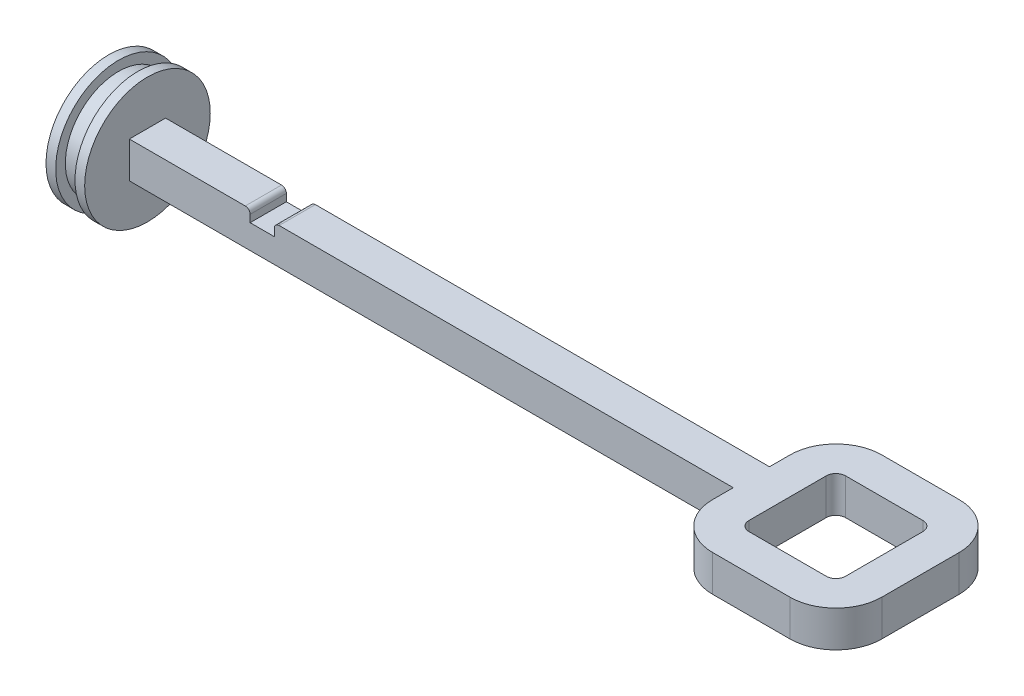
ISO-10303-21;
HEADER;
FILE_DESCRIPTION(('STEP AP214'),'2;1');
FILE_NAME('part.step','',(''),(''),'','','');
FILE_SCHEMA(('AUTOMOTIVE_DESIGN { 1 0 10303 214 1 1 1 1 }'));
ENDSEC;
DATA;
#1=APPLICATION_CONTEXT('core data for automotive mechanical design processes');
#2=APPLICATION_PROTOCOL_DEFINITION('international standard','automotive_design',2000,#1);
#3=PRODUCT_CONTEXT('',#1,'mechanical');
#4=PRODUCT('Part','Part','',(#3));
#5=PRODUCT_RELATED_PRODUCT_CATEGORY('part','',(#4));
#6=PRODUCT_DEFINITION_FORMATION('','',#4);
#7=PRODUCT_DEFINITION_CONTEXT('part definition',#1,'design');
#8=PRODUCT_DEFINITION('design','',#6,#7);
#9=PRODUCT_DEFINITION_SHAPE('','',#8);
#10=(LENGTH_UNIT() NAMED_UNIT(*) SI_UNIT(.MILLI.,.METRE.));
#11=(NAMED_UNIT(*) PLANE_ANGLE_UNIT() SI_UNIT($,.RADIAN.));
#12=(NAMED_UNIT(*) SI_UNIT($,.STERADIAN.) SOLID_ANGLE_UNIT());
#13=UNCERTAINTY_MEASURE_WITH_UNIT(LENGTH_MEASURE(1.E-05),#10,'distance_accuracy_value','');
#14=(GEOMETRIC_REPRESENTATION_CONTEXT(3) GLOBAL_UNCERTAINTY_ASSIGNED_CONTEXT((#13)) GLOBAL_UNIT_ASSIGNED_CONTEXT((#10,
#11,#12)) REPRESENTATION_CONTEXT('',''));
#15=CARTESIAN_POINT('',(0.,0.,0.));
#16=DIRECTION('',(0.,0.,1.));
#17=DIRECTION('',(1.,0.,0.));
#18=AXIS2_PLACEMENT_3D('',#15,#16,#17);
#19=CARTESIAN_POINT('',(0.,3.75,0.));
#20=DIRECTION('',(0.,1.,0.));
#21=DIRECTION('',(0.,0.,1.));
#22=AXIS2_PLACEMENT_3D('',#19,#20,#21);
#23=PLANE('',#22);
#24=DIRECTION('',(1.,0.,0.));
#25=VECTOR('',#24,1.);
#26=CARTESIAN_POINT('',(-62.5,3.75,3.75));
#27=LINE('',#26,#25);
#28=CARTESIAN_POINT('',(-62.5,3.75,3.75));
#29=VERTEX_POINT('',#28);
#30=CARTESIAN_POINT('',(-38.5,3.75,3.75));
#31=VERTEX_POINT('',#30);
#32=EDGE_CURVE('E321',#29,#31,#27,.T.);
#33=ORIENTED_EDGE('',*,*,#32,.T.);
#34=DIRECTION('',(0.,0.,1.));
#35=VECTOR('',#34,1.);
#36=CARTESIAN_POINT('',(-38.5,3.75,-3.75));
#37=LINE('',#36,#35);
#38=CARTESIAN_POINT('',(-38.5,3.75,-3.75));
#39=VERTEX_POINT('',#38);
#40=EDGE_CURVE('E11',#31,#39,#37,.F.);
#41=ORIENTED_EDGE('',*,*,#40,.T.);
#42=DIRECTION('',(-1.,0.,0.));
#43=VECTOR('',#42,1.);
#44=CARTESIAN_POINT('',(-62.5,3.75,-3.75));
#45=LINE('',#44,#43);
#46=CARTESIAN_POINT('',(-62.5,3.75,-3.75));
#47=VERTEX_POINT('',#46);
#48=EDGE_CURVE('E311',#39,#47,#45,.T.);
#49=ORIENTED_EDGE('',*,*,#48,.T.);
#50=DIRECTION('',(0.,0.,1.));
#51=VECTOR('',#50,1.);
#52=CARTESIAN_POINT('',(-62.5,3.75,-3.75));
#53=LINE('',#52,#51);
#54=EDGE_CURVE('E317',#47,#29,#53,.T.);
#55=ORIENTED_EDGE('',*,*,#54,.T.);
#56=EDGE_LOOP('',(#33,#41,#49,#55));
#57=FACE_BOUND('',#56,.T.);
#58=ADVANCED_FACE('F39',(#57),#23,.T.);
#59=CARTESIAN_POINT('',(-70.5,0.,0.));
#60=DIRECTION('',(1.,0.,0.));
#61=DIRECTION('',(0.,0.,-1.));
#62=AXIS2_PLACEMENT_3D('',#59,#60,#61);
#63=CYLINDRICAL_SURFACE('',#62,13.);
#64=CARTESIAN_POINT('',(-64.5,0.,0.));
#65=DIRECTION('',(1.,0.,0.));
#66=DIRECTION('',(0.,0.,-1.));
#67=AXIS2_PLACEMENT_3D('',#64,#65,#66);
#68=CIRCLE('',#67,13.);
#69=CARTESIAN_POINT('',(-64.5,0.,-13.));
#70=VERTEX_POINT('',#69);
#71=EDGE_CURVE('E263',#70,#70,#68,.T.);
#72=ORIENTED_EDGE('',*,*,#71,.T.);
#73=EDGE_LOOP('',(#72));
#74=FACE_BOUND('',#73,.T.);
#75=CARTESIAN_POINT('',(-62.5,0.,0.));
#76=DIRECTION('',(-1.,0.,0.));
#77=DIRECTION('',(0.,0.,1.));
#78=AXIS2_PLACEMENT_3D('',#75,#76,#77);
#79=CIRCLE('',#78,13.);
#80=CARTESIAN_POINT('',(-62.5,0.,13.));
#81=VERTEX_POINT('',#80);
#82=EDGE_CURVE('E267',#81,#81,#79,.T.);
#83=ORIENTED_EDGE('',*,*,#82,.T.);
#84=EDGE_LOOP('',(#83));
#85=FACE_BOUND('',#84,.T.);
#86=ADVANCED_FACE('F580',(#74,#85),#63,.T.);
#87=CARTESIAN_POINT('',(62.5,3.75,-3.75));
#88=VERTEX_POINT('',#87);
#89=CARTESIAN_POINT('',(-31.5,3.75,-3.75));
#90=VERTEX_POINT('',#89);
#91=EDGE_CURVE('E313',#88,#90,#45,.T.);
#92=ORIENTED_EDGE('',*,*,#91,.T.);
#93=DIRECTION('',(0.,0.,1.));
#94=VECTOR('',#93,1.);
#95=CARTESIAN_POINT('',(-31.5,3.75,3.75));
#96=LINE('',#95,#94);
#97=CARTESIAN_POINT('',(-31.5,3.75,3.75));
#98=VERTEX_POINT('',#97);
#99=EDGE_CURVE('E487',#90,#98,#96,.T.);
#100=ORIENTED_EDGE('',*,*,#99,.T.);
#101=CARTESIAN_POINT('',(62.5,3.75,3.75));
#102=VERTEX_POINT('',#101);
#103=EDGE_CURVE('E320',#98,#102,#27,.T.);
#104=ORIENTED_EDGE('',*,*,#103,.T.);
#105=DIRECTION('',(0.,0.,1.));
#106=VECTOR('',#105,1.);
#107=CARTESIAN_POINT('',(62.5,3.75,3.75));
#108=LINE('',#107,#106);
#109=CARTESIAN_POINT('',(62.5,3.75,8.));
#110=VERTEX_POINT('',#109);
#111=EDGE_CURVE('E324',#102,#110,#108,.T.);
#112=ORIENTED_EDGE('',*,*,#111,.T.);
#113=CARTESIAN_POINT('',(72.,3.75,8.));
#114=DIRECTION('',(0.,1.,0.));
#115=DIRECTION('',(0.,0.,1.));
#116=AXIS2_PLACEMENT_3D('',#113,#114,#115);
#117=CIRCLE('',#116,9.5);
#118=CARTESIAN_POINT('',(72.,3.75,17.5));
#119=VERTEX_POINT('',#118);
#120=EDGE_CURVE('E415',#110,#119,#117,.T.);
#121=ORIENTED_EDGE('',*,*,#120,.T.);
#122=DIRECTION('',(1.,0.,0.));
#123=VECTOR('',#122,1.);
#124=CARTESIAN_POINT('',(97.5,3.75,17.5));
#125=LINE('',#124,#123);
#126=CARTESIAN_POINT('',(88.,3.75,17.5));
#127=VERTEX_POINT('',#126);
#128=EDGE_CURVE('E328',#119,#127,#125,.T.);
#129=ORIENTED_EDGE('',*,*,#128,.T.);
#130=CARTESIAN_POINT('',(88.,3.75,8.));
#131=DIRECTION('',(0.,1.,0.));
#132=DIRECTION('',(0.,0.,1.));
#133=AXIS2_PLACEMENT_3D('',#130,#131,#132);
#134=CIRCLE('',#133,9.5);
#135=CARTESIAN_POINT('',(97.5,3.75,8.));
#136=VERTEX_POINT('',#135);
#137=EDGE_CURVE('E418',#127,#136,#134,.T.);
#138=ORIENTED_EDGE('',*,*,#137,.T.);
#139=DIRECTION('',(0.,0.,-1.));
#140=VECTOR('',#139,1.);
#141=CARTESIAN_POINT('',(97.5,3.75,-17.5));
#142=LINE('',#141,#140);
#143=CARTESIAN_POINT('',(97.5,3.75,-8.));
#144=VERTEX_POINT('',#143);
#145=EDGE_CURVE('E332',#136,#144,#142,.T.);
#146=ORIENTED_EDGE('',*,*,#145,.T.);
#147=CARTESIAN_POINT('',(88.,3.75,-8.));
#148=DIRECTION('',(0.,1.,0.));
#149=DIRECTION('',(0.,0.,1.));
#150=AXIS2_PLACEMENT_3D('',#147,#148,#149);
#151=CIRCLE('',#150,9.5);
#152=CARTESIAN_POINT('',(88.,3.75,-17.5));
#153=VERTEX_POINT('',#152);
#154=EDGE_CURVE('E412',#144,#153,#151,.T.);
#155=ORIENTED_EDGE('',*,*,#154,.T.);
#156=DIRECTION('',(-1.,0.,0.));
#157=VECTOR('',#156,1.);
#158=CARTESIAN_POINT('',(62.5,3.75,-17.5));
#159=LINE('',#158,#157);
#160=CARTESIAN_POINT('',(72.,3.75,-17.5));
#161=VERTEX_POINT('',#160);
#162=EDGE_CURVE('E336',#153,#161,#159,.T.);
#163=ORIENTED_EDGE('',*,*,#162,.T.);
#164=CARTESIAN_POINT('',(72.,3.75,-8.));
#165=DIRECTION('',(0.,1.,0.));
#166=DIRECTION('',(0.,0.,1.));
#167=AXIS2_PLACEMENT_3D('',#164,#165,#166);
#168=CIRCLE('',#167,9.5);
#169=CARTESIAN_POINT('',(62.5,3.75,-7.99999999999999));
#170=VERTEX_POINT('',#169);
#171=EDGE_CURVE('E409',#161,#170,#168,.T.);
#172=ORIENTED_EDGE('',*,*,#171,.T.);
#173=DIRECTION('',(0.,0.,1.));
#174=VECTOR('',#173,1.);
#175=CARTESIAN_POINT('',(62.5,3.75,-17.5));
#176=LINE('',#175,#174);
#177=EDGE_CURVE('E308',#170,#88,#176,.T.);
#178=ORIENTED_EDGE('',*,*,#177,.T.);
#179=EDGE_LOOP('',(#92,#100,#104,#112,#121,#129,#138,#146,#155,#163,#172,#178));
#180=FACE_BOUND('',#179,.T.);
#181=DIRECTION('',(0.,0.,-1.));
#182=VECTOR('',#181,1.);
#183=CARTESIAN_POINT('',(90.,3.75,-10.));
#184=LINE('',#183,#182);
#185=CARTESIAN_POINT('',(90.,3.75,8.));
#186=VERTEX_POINT('',#185);
#187=CARTESIAN_POINT('',(90.,3.75,-8.));
#188=VERTEX_POINT('',#187);
#189=EDGE_CURVE('E280',#186,#188,#184,.T.);
#190=ORIENTED_EDGE('',*,*,#189,.F.);
#191=CARTESIAN_POINT('',(88.,3.75,8.));
#192=DIRECTION('',(0.,1.,0.));
#193=DIRECTION('',(0.,0.,1.));
#194=AXIS2_PLACEMENT_3D('',#191,#192,#193);
#195=CIRCLE('',#194,2.);
#196=CARTESIAN_POINT('',(88.,3.75,10.));
#197=VERTEX_POINT('',#196);
#198=EDGE_CURVE('E472',#186,#197,#195,.F.);
#199=ORIENTED_EDGE('',*,*,#198,.T.);
#200=DIRECTION('',(1.,0.,0.));
#201=VECTOR('',#200,1.);
#202=CARTESIAN_POINT('',(90.,3.75,10.));
#203=LINE('',#202,#201);
#204=CARTESIAN_POINT('',(72.,3.75,10.));
#205=VERTEX_POINT('',#204);
#206=EDGE_CURVE('E276',#205,#197,#203,.T.);
#207=ORIENTED_EDGE('',*,*,#206,.F.);
#208=CARTESIAN_POINT('',(72.,3.75,8.));
#209=DIRECTION('',(0.,1.,0.));
#210=DIRECTION('',(0.,0.,1.));
#211=AXIS2_PLACEMENT_3D('',#208,#209,#210);
#212=CIRCLE('',#211,2.);
#213=CARTESIAN_POINT('',(70.,3.75,8.));
#214=VERTEX_POINT('',#213);
#215=EDGE_CURVE('E466',#205,#214,#212,.F.);
#216=ORIENTED_EDGE('',*,*,#215,.T.);
#217=DIRECTION('',(0.,0.,1.));
#218=VECTOR('',#217,1.);
#219=CARTESIAN_POINT('',(70.,3.75,-10.));
#220=LINE('',#219,#218);
#221=CARTESIAN_POINT('',(70.,3.75,-8.));
#222=VERTEX_POINT('',#221);
#223=EDGE_CURVE('E289',#222,#214,#220,.T.);
#224=ORIENTED_EDGE('',*,*,#223,.F.);
#225=CARTESIAN_POINT('',(72.,3.75,-8.));
#226=DIRECTION('',(0.,1.,0.));
#227=DIRECTION('',(0.,0.,1.));
#228=AXIS2_PLACEMENT_3D('',#225,#226,#227);
#229=CIRCLE('',#228,2.);
#230=CARTESIAN_POINT('',(72.,3.75,-10.));
#231=VERTEX_POINT('',#230);
#232=EDGE_CURVE('E484',#222,#231,#229,.F.);
#233=ORIENTED_EDGE('',*,*,#232,.T.);
#234=DIRECTION('',(-1.,0.,0.));
#235=VECTOR('',#234,1.);
#236=CARTESIAN_POINT('',(70.,3.75,-10.));
#237=LINE('',#236,#235);
#238=CARTESIAN_POINT('',(88.,3.75,-10.));
#239=VERTEX_POINT('',#238);
#240=EDGE_CURVE('E285',#239,#231,#237,.T.);
#241=ORIENTED_EDGE('',*,*,#240,.F.);
#242=CARTESIAN_POINT('',(88.,3.75,-8.));
#243=DIRECTION('',(0.,1.,0.));
#244=DIRECTION('',(0.,0.,1.));
#245=AXIS2_PLACEMENT_3D('',#242,#243,#244);
#246=CIRCLE('',#245,2.);
#247=EDGE_CURVE('E478',#239,#188,#246,.F.);
#248=ORIENTED_EDGE('',*,*,#247,.T.);
#249=EDGE_LOOP('',(#190,#199,#207,#216,#224,#233,#241,#248));
#250=FACE_BOUND('',#249,.T.);
#251=ADVANCED_FACE('F521',(#180,#250),#23,.T.);
#252=CARTESIAN_POINT('',(0.,-3.75,0.));
#253=DIRECTION('',(0.,1.,0.));
#254=DIRECTION('',(0.,0.,1.));
#255=AXIS2_PLACEMENT_3D('',#252,#253,#254);
#256=PLANE('',#255);
#257=DIRECTION('',(0.,0.,-1.));
#258=VECTOR('',#257,1.);
#259=CARTESIAN_POINT('',(97.5,-3.75,-17.5));
#260=LINE('',#259,#258);
#261=CARTESIAN_POINT('',(97.5,-3.75,8.));
#262=VERTEX_POINT('',#261);
#263=CARTESIAN_POINT('',(97.5,-3.75,-8.));
#264=VERTEX_POINT('',#263);
#265=EDGE_CURVE('E362',#262,#264,#260,.T.);
#266=ORIENTED_EDGE('',*,*,#265,.F.);
#267=CARTESIAN_POINT('',(88.,-3.75,8.));
#268=DIRECTION('',(0.,1.,0.));
#269=DIRECTION('',(0.,0.,1.));
#270=AXIS2_PLACEMENT_3D('',#267,#268,#269);
#271=CIRCLE('',#270,9.5);
#272=CARTESIAN_POINT('',(88.,-3.75,17.5));
#273=VERTEX_POINT('',#272);
#274=EDGE_CURVE('E399',#262,#273,#271,.F.);
#275=ORIENTED_EDGE('',*,*,#274,.T.);
#276=DIRECTION('',(1.,0.,0.));
#277=VECTOR('',#276,1.);
#278=CARTESIAN_POINT('',(97.5,-3.75,17.5));
#279=LINE('',#278,#277);
#280=CARTESIAN_POINT('',(72.,-3.75,17.5));
#281=VERTEX_POINT('',#280);
#282=EDGE_CURVE('E358',#281,#273,#279,.T.);
#283=ORIENTED_EDGE('',*,*,#282,.F.);
#284=CARTESIAN_POINT('',(72.,-3.75,8.));
#285=DIRECTION('',(0.,1.,0.));
#286=DIRECTION('',(0.,0.,1.));
#287=AXIS2_PLACEMENT_3D('',#284,#285,#286);
#288=CIRCLE('',#287,9.5);
#289=CARTESIAN_POINT('',(62.5,-3.75,8.));
#290=VERTEX_POINT('',#289);
#291=EDGE_CURVE('E396',#281,#290,#288,.F.);
#292=ORIENTED_EDGE('',*,*,#291,.T.);
#293=DIRECTION('',(0.,0.,1.));
#294=VECTOR('',#293,1.);
#295=CARTESIAN_POINT('',(62.5,-3.75,3.75));
#296=LINE('',#295,#294);
#297=CARTESIAN_POINT('',(62.5,-3.75,3.75));
#298=VERTEX_POINT('',#297);
#299=EDGE_CURVE('E354',#298,#290,#296,.T.);
#300=ORIENTED_EDGE('',*,*,#299,.F.);
#301=DIRECTION('',(1.,0.,0.));
#302=VECTOR('',#301,1.);
#303=CARTESIAN_POINT('',(-62.5,-3.75,3.75));
#304=LINE('',#303,#302);
#305=CARTESIAN_POINT('',(-62.5,-3.75,3.75));
#306=VERTEX_POINT('',#305);
#307=EDGE_CURVE('E351',#306,#298,#304,.T.);
#308=ORIENTED_EDGE('',*,*,#307,.F.);
#309=DIRECTION('',(0.,0.,1.));
#310=VECTOR('',#309,1.);
#311=CARTESIAN_POINT('',(-62.5,-3.75,-3.75));
#312=LINE('',#311,#310);
#313=CARTESIAN_POINT('',(-62.5,-3.75,-3.75));
#314=VERTEX_POINT('',#313);
#315=EDGE_CURVE('E347',#314,#306,#312,.T.);
#316=ORIENTED_EDGE('',*,*,#315,.F.);
#317=DIRECTION('',(-1.,0.,0.));
#318=VECTOR('',#317,1.);
#319=CARTESIAN_POINT('',(-62.5,-3.75,-3.75));
#320=LINE('',#319,#318);
#321=CARTESIAN_POINT('',(62.5,-3.75,-3.75));
#322=VERTEX_POINT('',#321);
#323=EDGE_CURVE('E343',#322,#314,#320,.T.);
#324=ORIENTED_EDGE('',*,*,#323,.F.);
#325=DIRECTION('',(0.,0.,1.));
#326=VECTOR('',#325,1.);
#327=CARTESIAN_POINT('',(62.5,-3.75,-17.5));
#328=LINE('',#327,#326);
#329=CARTESIAN_POINT('',(62.5,-3.75,-7.99999999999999));
#330=VERTEX_POINT('',#329);
#331=EDGE_CURVE('E293',#330,#322,#328,.T.);
#332=ORIENTED_EDGE('',*,*,#331,.F.);
#333=CARTESIAN_POINT('',(72.,-3.75,-8.));
#334=DIRECTION('',(0.,1.,0.));
#335=DIRECTION('',(0.,0.,1.));
#336=AXIS2_PLACEMENT_3D('',#333,#334,#335);
#337=CIRCLE('',#336,9.5);
#338=CARTESIAN_POINT('',(72.,-3.75,-17.5));
#339=VERTEX_POINT('',#338);
#340=EDGE_CURVE('E390',#330,#339,#337,.F.);
#341=ORIENTED_EDGE('',*,*,#340,.T.);
#342=DIRECTION('',(-1.,0.,0.));
#343=VECTOR('',#342,1.);
#344=CARTESIAN_POINT('',(62.5,-3.75,-17.5));
#345=LINE('',#344,#343);
#346=CARTESIAN_POINT('',(88.,-3.75,-17.5));
#347=VERTEX_POINT('',#346);
#348=EDGE_CURVE('E312',#347,#339,#345,.T.);
#349=ORIENTED_EDGE('',*,*,#348,.F.);
#350=CARTESIAN_POINT('',(88.,-3.75,-8.));
#351=DIRECTION('',(0.,1.,0.));
#352=DIRECTION('',(0.,0.,1.));
#353=AXIS2_PLACEMENT_3D('',#350,#351,#352);
#354=CIRCLE('',#353,9.5);
#355=EDGE_CURVE('E393',#347,#264,#354,.F.);
#356=ORIENTED_EDGE('',*,*,#355,.T.);
#357=EDGE_LOOP('',(#266,#275,#283,#292,#300,#308,#316,#324,#332,#341,#349,#356));
#358=FACE_BOUND('',#357,.T.);
#359=DIRECTION('',(0.,0.,1.));
#360=VECTOR('',#359,1.);
#361=CARTESIAN_POINT('',(70.,-3.75,-10.));
#362=LINE('',#361,#360);
#363=CARTESIAN_POINT('',(70.,-3.75,-8.));
#364=VERTEX_POINT('',#363);
#365=CARTESIAN_POINT('',(70.,-3.75,8.));
#366=VERTEX_POINT('',#365);
#367=EDGE_CURVE('E281',#364,#366,#362,.T.);
#368=ORIENTED_EDGE('',*,*,#367,.T.);
#369=CARTESIAN_POINT('',(72.,-3.75,8.));
#370=DIRECTION('',(0.,1.,0.));
#371=DIRECTION('',(0.,0.,1.));
#372=AXIS2_PLACEMENT_3D('',#369,#370,#371);
#373=CIRCLE('',#372,2.);
#374=CARTESIAN_POINT('',(72.,-3.75,10.));
#375=VERTEX_POINT('',#374);
#376=EDGE_CURVE('E463',#366,#375,#373,.T.);
#377=ORIENTED_EDGE('',*,*,#376,.T.);
#378=DIRECTION('',(1.,0.,0.));
#379=VECTOR('',#378,1.);
#380=CARTESIAN_POINT('',(90.,-3.75,10.));
#381=LINE('',#380,#379);
#382=CARTESIAN_POINT('',(88.,-3.75,10.));
#383=VERTEX_POINT('',#382);
#384=EDGE_CURVE('E272',#375,#383,#381,.T.);
#385=ORIENTED_EDGE('',*,*,#384,.T.);
#386=CARTESIAN_POINT('',(88.,-3.75,8.));
#387=DIRECTION('',(0.,1.,0.));
#388=DIRECTION('',(0.,0.,1.));
#389=AXIS2_PLACEMENT_3D('',#386,#387,#388);
#390=CIRCLE('',#389,2.);
#391=CARTESIAN_POINT('',(90.,-3.75,8.));
#392=VERTEX_POINT('',#391);
#393=EDGE_CURVE('E469',#383,#392,#390,.T.);
#394=ORIENTED_EDGE('',*,*,#393,.T.);
#395=DIRECTION('',(0.,0.,-1.));
#396=VECTOR('',#395,1.);
#397=CARTESIAN_POINT('',(90.,-3.75,-10.));
#398=LINE('',#397,#396);
#399=CARTESIAN_POINT('',(90.,-3.75,-8.));
#400=VERTEX_POINT('',#399);
#401=EDGE_CURVE('E297',#392,#400,#398,.T.);
#402=ORIENTED_EDGE('',*,*,#401,.T.);
#403=CARTESIAN_POINT('',(88.,-3.75,-8.));
#404=DIRECTION('',(0.,1.,0.));
#405=DIRECTION('',(0.,0.,1.));
#406=AXIS2_PLACEMENT_3D('',#403,#404,#405);
#407=CIRCLE('',#406,2.);
#408=CARTESIAN_POINT('',(88.,-3.75,-10.));
#409=VERTEX_POINT('',#408);
#410=EDGE_CURVE('E475',#400,#409,#407,.T.);
#411=ORIENTED_EDGE('',*,*,#410,.T.);
#412=DIRECTION('',(-1.,0.,0.));
#413=VECTOR('',#412,1.);
#414=CARTESIAN_POINT('',(70.,-3.75,-10.));
#415=LINE('',#414,#413);
#416=CARTESIAN_POINT('',(72.,-3.75,-10.));
#417=VERTEX_POINT('',#416);
#418=EDGE_CURVE('E301',#409,#417,#415,.T.);
#419=ORIENTED_EDGE('',*,*,#418,.T.);
#420=CARTESIAN_POINT('',(72.,-3.75,-8.));
#421=DIRECTION('',(0.,1.,0.));
#422=DIRECTION('',(0.,0.,1.));
#423=AXIS2_PLACEMENT_3D('',#420,#421,#422);
#424=CIRCLE('',#423,2.);
#425=EDGE_CURVE('E481',#417,#364,#424,.T.);
#426=ORIENTED_EDGE('',*,*,#425,.T.);
#427=EDGE_LOOP('',(#368,#377,#385,#394,#402,#411,#419,#426));
#428=FACE_BOUND('',#427,.T.);
#429=ADVANCED_FACE('F535',(#358,#428),#256,.F.);
#430=CARTESIAN_POINT('',(62.5,3.75,-17.5));
#431=DIRECTION('',(1.,0.,0.));
#432=DIRECTION('',(0.,0.,-1.));
#433=AXIS2_PLACEMENT_3D('',#430,#431,#432);
#434=PLANE('',#433);
#435=ORIENTED_EDGE('',*,*,#177,.F.);
#436=DIRECTION('',(0.,-1.,0.));
#437=VECTOR('',#436,1.);
#438=CARTESIAN_POINT('',(62.5,3.75,-7.99999999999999));
#439=LINE('',#438,#437);
#440=EDGE_CURVE('E431',#170,#330,#439,.T.);
#441=ORIENTED_EDGE('',*,*,#440,.T.);
#442=ORIENTED_EDGE('',*,*,#331,.T.);
#443=DIRECTION('',(0.,-1.,0.));
#444=VECTOR('',#443,1.);
#445=CARTESIAN_POINT('',(62.5,3.75,-3.75));
#446=LINE('',#445,#444);
#447=EDGE_CURVE('E379',#88,#322,#446,.T.);
#448=ORIENTED_EDGE('',*,*,#447,.F.);
#449=EDGE_LOOP('',(#435,#441,#442,#448));
#450=FACE_BOUND('',#449,.T.);
#451=ADVANCED_FACE('F527',(#450),#434,.F.);
#452=CARTESIAN_POINT('',(-62.5,3.75,-3.75));
#453=DIRECTION('',(0.,0.,1.));
#454=DIRECTION('',(1.,0.,0.));
#455=AXIS2_PLACEMENT_3D('',#452,#453,#454);
#456=PLANE('',#455);
#457=DIRECTION('',(0.,1.,0.));
#458=VECTOR('',#457,1.);
#459=CARTESIAN_POINT('',(-32.5,3.75,-3.75));
#460=LINE('',#459,#458);
#461=CARTESIAN_POINT('',(-32.5,1.25,-3.75));
#462=VERTEX_POINT('',#461);
#463=CARTESIAN_POINT('',(-32.5,2.75,-3.75));
#464=VERTEX_POINT('',#463);
#465=EDGE_CURVE('E232',#462,#464,#460,.T.);
#466=ORIENTED_EDGE('',*,*,#465,.T.);
#467=CARTESIAN_POINT('',(-31.5,2.75,-3.75));
#468=DIRECTION('',(0.,0.,1.));
#469=DIRECTION('',(1.,0.,0.));
#470=AXIS2_PLACEMENT_3D('',#467,#468,#469);
#471=CIRCLE('',#470,1.);
#472=EDGE_CURVE('E502',#464,#90,#471,.F.);
#473=ORIENTED_EDGE('',*,*,#472,.T.);
#474=ORIENTED_EDGE('',*,*,#91,.F.);
#475=ORIENTED_EDGE('',*,*,#447,.T.);
#476=ORIENTED_EDGE('',*,*,#323,.T.);
#477=DIRECTION('',(0.,-1.,0.));
#478=VECTOR('',#477,1.);
#479=CARTESIAN_POINT('',(-62.5,3.75,-3.75));
#480=LINE('',#479,#478);
#481=EDGE_CURVE('E375',#47,#314,#480,.T.);
#482=ORIENTED_EDGE('',*,*,#481,.F.);
#483=ORIENTED_EDGE('',*,*,#48,.F.);
#484=CARTESIAN_POINT('',(-38.5,2.75,-3.75));
#485=DIRECTION('',(0.,0.,1.));
#486=DIRECTION('',(1.,0.,0.));
#487=AXIS2_PLACEMENT_3D('',#484,#485,#486);
#488=CIRCLE('',#487,1.);
#489=CARTESIAN_POINT('',(-37.5,2.75,-3.75));
#490=VERTEX_POINT('',#489);
#491=EDGE_CURVE('E55',#39,#490,#488,.F.);
#492=ORIENTED_EDGE('',*,*,#491,.T.);
#493=DIRECTION('',(0.,-1.,0.));
#494=VECTOR('',#493,1.);
#495=CARTESIAN_POINT('',(-37.5,3.75,-3.75));
#496=LINE('',#495,#494);
#497=CARTESIAN_POINT('',(-37.5,1.25,-3.75));
#498=VERTEX_POINT('',#497);
#499=EDGE_CURVE('E210',#490,#498,#496,.T.);
#500=ORIENTED_EDGE('',*,*,#499,.T.);
#501=DIRECTION('',(1.,0.,0.));
#502=VECTOR('',#501,1.);
#503=CARTESIAN_POINT('',(-37.5,1.25,-3.75));
#504=LINE('',#503,#502);
#505=EDGE_CURVE('E215',#498,#462,#504,.T.);
#506=ORIENTED_EDGE('',*,*,#505,.T.);
#507=EDGE_LOOP('',(#466,#473,#474,#475,#476,#482,#483,#492,#500,#506));
#508=FACE_BOUND('',#507,.T.);
#509=ADVANCED_FACE('F213',(#508),#456,.F.);
#510=CARTESIAN_POINT('',(-62.5,3.75,3.75));
#511=DIRECTION('',(0.,0.,-1.));
#512=DIRECTION('',(-1.,0.,0.));
#513=AXIS2_PLACEMENT_3D('',#510,#511,#512);
#514=PLANE('',#513);
#515=ORIENTED_EDGE('',*,*,#103,.F.);
#516=CARTESIAN_POINT('',(-31.5,2.75,3.75));
#517=DIRECTION('',(0.,0.,-1.));
#518=DIRECTION('',(-1.,0.,0.));
#519=AXIS2_PLACEMENT_3D('',#516,#517,#518);
#520=CIRCLE('',#519,1.);
#521=CARTESIAN_POINT('',(-32.5,2.75,3.75));
#522=VERTEX_POINT('',#521);
#523=EDGE_CURVE('E494',#98,#522,#520,.F.);
#524=ORIENTED_EDGE('',*,*,#523,.T.);
#525=DIRECTION('',(0.,1.,0.));
#526=VECTOR('',#525,1.);
#527=CARTESIAN_POINT('',(-32.5,3.75,3.75));
#528=LINE('',#527,#526);
#529=CARTESIAN_POINT('',(-32.5,1.25,3.75));
#530=VERTEX_POINT('',#529);
#531=EDGE_CURVE('E220',#530,#522,#528,.T.);
#532=ORIENTED_EDGE('',*,*,#531,.F.);
#533=DIRECTION('',(1.,0.,0.));
#534=VECTOR('',#533,1.);
#535=CARTESIAN_POINT('',(-37.5,1.25,3.75));
#536=LINE('',#535,#534);
#537=CARTESIAN_POINT('',(-37.5,1.25,3.75));
#538=VERTEX_POINT('',#537);
#539=EDGE_CURVE('E243',#538,#530,#536,.T.);
#540=ORIENTED_EDGE('',*,*,#539,.F.);
#541=DIRECTION('',(0.,-1.,0.));
#542=VECTOR('',#541,1.);
#543=CARTESIAN_POINT('',(-37.5,3.75,3.75));
#544=LINE('',#543,#542);
#545=CARTESIAN_POINT('',(-37.5,2.75,3.75));
#546=VERTEX_POINT('',#545);
#547=EDGE_CURVE('E226',#546,#538,#544,.T.);
#548=ORIENTED_EDGE('',*,*,#547,.F.);
#549=CARTESIAN_POINT('',(-38.5,2.75,3.75));
#550=DIRECTION('',(0.,0.,-1.));
#551=DIRECTION('',(-1.,0.,0.));
#552=AXIS2_PLACEMENT_3D('',#549,#550,#551);
#553=CIRCLE('',#552,1.);
#554=EDGE_CURVE('E491',#546,#31,#553,.F.);
#555=ORIENTED_EDGE('',*,*,#554,.T.);
#556=ORIENTED_EDGE('',*,*,#32,.F.);
#557=DIRECTION('',(0.,-1.,0.));
#558=VECTOR('',#557,1.);
#559=CARTESIAN_POINT('',(-62.5,3.75,3.75));
#560=LINE('',#559,#558);
#561=EDGE_CURVE('E372',#29,#306,#560,.T.);
#562=ORIENTED_EDGE('',*,*,#561,.T.);
#563=ORIENTED_EDGE('',*,*,#307,.T.);
#564=DIRECTION('',(0.,-1.,0.));
#565=VECTOR('',#564,1.);
#566=CARTESIAN_POINT('',(62.5,3.75,3.75));
#567=LINE('',#566,#565);
#568=EDGE_CURVE('E340',#102,#298,#567,.T.);
#569=ORIENTED_EDGE('',*,*,#568,.F.);
#570=EDGE_LOOP('',(#515,#524,#532,#540,#548,#555,#556,#562,#563,#569));
#571=FACE_BOUND('',#570,.T.);
#572=ADVANCED_FACE('F508',(#571),#514,.F.);
#573=CARTESIAN_POINT('',(62.5,3.75,3.75));
#574=DIRECTION('',(1.,0.,0.));
#575=DIRECTION('',(0.,0.,-1.));
#576=AXIS2_PLACEMENT_3D('',#573,#574,#575);
#577=PLANE('',#576);
#578=ORIENTED_EDGE('',*,*,#299,.T.);
#579=DIRECTION('',(0.,-1.,0.));
#580=VECTOR('',#579,1.);
#581=CARTESIAN_POINT('',(62.5,3.75,8.));
#582=LINE('',#581,#580);
#583=EDGE_CURVE('E421',#290,#110,#582,.F.);
#584=ORIENTED_EDGE('',*,*,#583,.T.);
#585=ORIENTED_EDGE('',*,*,#111,.F.);
#586=ORIENTED_EDGE('',*,*,#568,.T.);
#587=EDGE_LOOP('',(#578,#584,#585,#586));
#588=FACE_BOUND('',#587,.T.);
#589=ADVANCED_FACE('F566',(#588),#577,.F.);
#590=CARTESIAN_POINT('',(97.5,3.75,17.5));
#591=DIRECTION('',(0.,0.,-1.));
#592=DIRECTION('',(-1.,0.,0.));
#593=AXIS2_PLACEMENT_3D('',#590,#591,#592);
#594=PLANE('',#593);
#595=ORIENTED_EDGE('',*,*,#282,.T.);
#596=DIRECTION('',(0.,-1.,0.));
#597=VECTOR('',#596,1.);
#598=CARTESIAN_POINT('',(88.,3.75,17.5));
#599=LINE('',#598,#597);
#600=EDGE_CURVE('E406',#273,#127,#599,.F.);
#601=ORIENTED_EDGE('',*,*,#600,.T.);
#602=ORIENTED_EDGE('',*,*,#128,.F.);
#603=DIRECTION('',(0.,-1.,0.));
#604=VECTOR('',#603,1.);
#605=CARTESIAN_POINT('',(72.,3.75,17.5));
#606=LINE('',#605,#604);
#607=EDGE_CURVE('E402',#119,#281,#606,.T.);
#608=ORIENTED_EDGE('',*,*,#607,.T.);
#609=EDGE_LOOP('',(#595,#601,#602,#608));
#610=FACE_BOUND('',#609,.T.);
#611=ADVANCED_FACE('F556',(#610),#594,.F.);
#612=CARTESIAN_POINT('',(97.5,3.75,-17.5));
#613=DIRECTION('',(-1.,0.,0.));
#614=DIRECTION('',(0.,0.,1.));
#615=AXIS2_PLACEMENT_3D('',#612,#613,#614);
#616=PLANE('',#615);
#617=ORIENTED_EDGE('',*,*,#145,.F.);
#618=DIRECTION('',(0.,-1.,0.));
#619=VECTOR('',#618,1.);
#620=CARTESIAN_POINT('',(97.5,3.75,8.));
#621=LINE('',#620,#619);
#622=EDGE_CURVE('E386',#136,#262,#621,.T.);
#623=ORIENTED_EDGE('',*,*,#622,.T.);
#624=ORIENTED_EDGE('',*,*,#265,.T.);
#625=DIRECTION('',(0.,-1.,0.));
#626=VECTOR('',#625,1.);
#627=CARTESIAN_POINT('',(97.5,3.75,-8.));
#628=LINE('',#627,#626);
#629=EDGE_CURVE('E383',#264,#144,#628,.F.);
#630=ORIENTED_EDGE('',*,*,#629,.T.);
#631=EDGE_LOOP('',(#617,#623,#624,#630));
#632=FACE_BOUND('',#631,.T.);
#633=ADVANCED_FACE('F548',(#632),#616,.F.);
#634=CARTESIAN_POINT('',(62.5,3.75,-17.5));
#635=DIRECTION('',(0.,0.,1.));
#636=DIRECTION('',(1.,0.,0.));
#637=AXIS2_PLACEMENT_3D('',#634,#635,#636);
#638=PLANE('',#637);
#639=ORIENTED_EDGE('',*,*,#162,.F.);
#640=DIRECTION('',(0.,-1.,0.));
#641=VECTOR('',#640,1.);
#642=CARTESIAN_POINT('',(88.,3.75,-17.5));
#643=LINE('',#642,#641);
#644=EDGE_CURVE('E427',#153,#347,#643,.T.);
#645=ORIENTED_EDGE('',*,*,#644,.T.);
#646=ORIENTED_EDGE('',*,*,#348,.T.);
#647=DIRECTION('',(0.,-1.,0.));
#648=VECTOR('',#647,1.);
#649=CARTESIAN_POINT('',(72.,3.75,-17.5));
#650=LINE('',#649,#648);
#651=EDGE_CURVE('E424',#339,#161,#650,.F.);
#652=ORIENTED_EDGE('',*,*,#651,.T.);
#653=EDGE_LOOP('',(#639,#645,#646,#652));
#654=FACE_BOUND('',#653,.T.);
#655=ADVANCED_FACE('F540',(#654),#638,.F.);
#656=CARTESIAN_POINT('',(90.,3.75,10.));
#657=DIRECTION('',(0.,0.,-1.));
#658=DIRECTION('',(-1.,0.,0.));
#659=AXIS2_PLACEMENT_3D('',#656,#657,#658);
#660=PLANE('',#659);
#661=ORIENTED_EDGE('',*,*,#384,.F.);
#662=DIRECTION('',(0.,-1.,0.));
#663=VECTOR('',#662,1.);
#664=CARTESIAN_POINT('',(72.,3.75,10.));
#665=LINE('',#664,#663);
#666=EDGE_CURVE('E446',#375,#205,#665,.F.);
#667=ORIENTED_EDGE('',*,*,#666,.T.);
#668=ORIENTED_EDGE('',*,*,#206,.T.);
#669=DIRECTION('',(0.,-1.,0.));
#670=VECTOR('',#669,1.);
#671=CARTESIAN_POINT('',(88.,-3.75,10.));
#672=LINE('',#671,#670);
#673=EDGE_CURVE('E442',#197,#383,#672,.T.);
#674=ORIENTED_EDGE('',*,*,#673,.T.);
#675=EDGE_LOOP('',(#661,#667,#668,#674));
#676=FACE_BOUND('',#675,.T.);
#677=ADVANCED_FACE('F601',(#676),#660,.T.);
#678=CARTESIAN_POINT('',(90.,3.75,-10.));
#679=DIRECTION('',(-1.,0.,0.));
#680=DIRECTION('',(0.,0.,1.));
#681=AXIS2_PLACEMENT_3D('',#678,#679,#680);
#682=PLANE('',#681);
#683=ORIENTED_EDGE('',*,*,#401,.F.);
#684=DIRECTION('',(0.,-1.,0.));
#685=VECTOR('',#684,1.);
#686=CARTESIAN_POINT('',(90.,3.75,8.));
#687=LINE('',#686,#685);
#688=EDGE_CURVE('E453',#392,#186,#687,.F.);
#689=ORIENTED_EDGE('',*,*,#688,.T.);
#690=ORIENTED_EDGE('',*,*,#189,.T.);
#691=DIRECTION('',(0.,-1.,0.));
#692=VECTOR('',#691,1.);
#693=CARTESIAN_POINT('',(90.,-3.75,-8.));
#694=LINE('',#693,#692);
#695=EDGE_CURVE('E449',#188,#400,#694,.T.);
#696=ORIENTED_EDGE('',*,*,#695,.T.);
#697=EDGE_LOOP('',(#683,#689,#690,#696));
#698=FACE_BOUND('',#697,.T.);
#699=ADVANCED_FACE('F654',(#698),#682,.T.);
#700=CARTESIAN_POINT('',(70.,3.75,-10.));
#701=DIRECTION('',(0.,0.,1.));
#702=DIRECTION('',(1.,0.,0.));
#703=AXIS2_PLACEMENT_3D('',#700,#701,#702);
#704=PLANE('',#703);
#705=ORIENTED_EDGE('',*,*,#418,.F.);
#706=DIRECTION('',(0.,-1.,0.));
#707=VECTOR('',#706,1.);
#708=CARTESIAN_POINT('',(88.,3.75,-10.));
#709=LINE('',#708,#707);
#710=EDGE_CURVE('E460',#409,#239,#709,.F.);
#711=ORIENTED_EDGE('',*,*,#710,.T.);
#712=ORIENTED_EDGE('',*,*,#240,.T.);
#713=DIRECTION('',(0.,-1.,0.));
#714=VECTOR('',#713,1.);
#715=CARTESIAN_POINT('',(72.,-3.75,-10.));
#716=LINE('',#715,#714);
#717=EDGE_CURVE('E456',#231,#417,#716,.T.);
#718=ORIENTED_EDGE('',*,*,#717,.T.);
#719=EDGE_LOOP('',(#705,#711,#712,#718));
#720=FACE_BOUND('',#719,.T.);
#721=ADVANCED_FACE('F648',(#720),#704,.T.);
#722=CARTESIAN_POINT('',(70.,3.75,-10.));
#723=DIRECTION('',(1.,0.,0.));
#724=DIRECTION('',(0.,0.,-1.));
#725=AXIS2_PLACEMENT_3D('',#722,#723,#724);
#726=PLANE('',#725);
#727=ORIENTED_EDGE('',*,*,#223,.T.);
#728=DIRECTION('',(0.,-1.,0.));
#729=VECTOR('',#728,1.);
#730=CARTESIAN_POINT('',(70.,-3.75,8.));
#731=LINE('',#730,#729);
#732=EDGE_CURVE('E438',#214,#366,#731,.T.);
#733=ORIENTED_EDGE('',*,*,#732,.T.);
#734=ORIENTED_EDGE('',*,*,#367,.F.);
#735=DIRECTION('',(0.,-1.,0.));
#736=VECTOR('',#735,1.);
#737=CARTESIAN_POINT('',(70.,3.75,-8.));
#738=LINE('',#737,#736);
#739=EDGE_CURVE('E435',#364,#222,#738,.F.);
#740=ORIENTED_EDGE('',*,*,#739,.T.);
#741=EDGE_LOOP('',(#727,#733,#734,#740));
#742=FACE_BOUND('',#741,.T.);
#743=ADVANCED_FACE('F664',(#742),#726,.T.);
#744=CARTESIAN_POINT('',(-62.5,0.,0.));
#745=DIRECTION('',(-1.,0.,0.));
#746=DIRECTION('',(0.,0.,1.));
#747=AXIS2_PLACEMENT_3D('',#744,#745,#746);
#748=PLANE('',#747);
#749=ORIENTED_EDGE('',*,*,#82,.F.);
#750=EDGE_LOOP('',(#749));
#751=FACE_BOUND('',#750,.T.);
#752=ORIENTED_EDGE('',*,*,#481,.T.);
#753=ORIENTED_EDGE('',*,*,#315,.T.);
#754=ORIENTED_EDGE('',*,*,#561,.F.);
#755=ORIENTED_EDGE('',*,*,#54,.F.);
#756=EDGE_LOOP('',(#752,#753,#754,#755));
#757=FACE_BOUND('',#756,.T.);
#758=ADVANCED_FACE('F571',(#751,#757),#748,.F.);
#759=CARTESIAN_POINT('',(-64.5,13.,0.));
#760=DIRECTION('',(1.,0.,0.));
#761=DIRECTION('',(0.,0.,-1.));
#762=AXIS2_PLACEMENT_3D('',#759,#760,#761);
#763=PLANE('',#762);
#764=ORIENTED_EDGE('',*,*,#71,.F.);
#765=EDGE_LOOP('',(#764));
#766=FACE_BOUND('',#765,.T.);
#767=CARTESIAN_POINT('',(-64.5,0.,0.));
#768=DIRECTION('',(1.,0.,0.));
#769=DIRECTION('',(0.,0.,-1.));
#770=AXIS2_PLACEMENT_3D('',#767,#768,#769);
#771=CIRCLE('',#770,11.);
#772=CARTESIAN_POINT('',(-64.5,0.,-11.));
#773=VERTEX_POINT('',#772);
#774=EDGE_CURVE('E250',#773,#773,#771,.T.);
#775=ORIENTED_EDGE('',*,*,#774,.T.);
#776=EDGE_LOOP('',(#775));
#777=FACE_BOUND('',#776,.T.);
#778=ADVANCED_FACE('F672',(#766,#777),#763,.F.);
#779=CARTESIAN_POINT('',(-68.5,11.,0.));
#780=DIRECTION('',(-1.,0.,0.));
#781=DIRECTION('',(0.,0.,1.));
#782=AXIS2_PLACEMENT_3D('',#779,#780,#781);
#783=PLANE('',#782);
#784=CARTESIAN_POINT('',(-68.5,0.,0.));
#785=DIRECTION('',(1.,0.,0.));
#786=DIRECTION('',(0.,0.,-1.));
#787=AXIS2_PLACEMENT_3D('',#784,#785,#786);
#788=CIRCLE('',#787,11.);
#789=CARTESIAN_POINT('',(-68.5,0.,-11.));
#790=VERTEX_POINT('',#789);
#791=EDGE_CURVE('E255',#790,#790,#788,.T.);
#792=ORIENTED_EDGE('',*,*,#791,.F.);
#793=EDGE_LOOP('',(#792));
#794=FACE_BOUND('',#793,.T.);
#795=CARTESIAN_POINT('',(-68.5,0.,0.));
#796=DIRECTION('',(1.,0.,0.));
#797=DIRECTION('',(0.,0.,-1.));
#798=AXIS2_PLACEMENT_3D('',#795,#796,#797);
#799=CIRCLE('',#798,13.);
#800=CARTESIAN_POINT('',(-68.5,0.,-13.));
#801=VERTEX_POINT('',#800);
#802=EDGE_CURVE('E259',#801,#801,#799,.T.);
#803=ORIENTED_EDGE('',*,*,#802,.T.);
#804=EDGE_LOOP('',(#803));
#805=FACE_BOUND('',#804,.T.);
#806=ADVANCED_FACE('F783',(#794,#805),#783,.F.);
#807=CARTESIAN_POINT('',(0.,0.,0.));
#808=DIRECTION('',(1.,0.,0.));
#809=DIRECTION('',(0.,0.,-1.));
#810=AXIS2_PLACEMENT_3D('',#807,#808,#809);
#811=CYLINDRICAL_SURFACE('',#810,11.);
#812=ORIENTED_EDGE('',*,*,#774,.F.);
#813=EDGE_LOOP('',(#812));
#814=FACE_BOUND('',#813,.T.);
#815=ORIENTED_EDGE('',*,*,#791,.T.);
#816=EDGE_LOOP('',(#815));
#817=FACE_BOUND('',#816,.T.);
#818=ADVANCED_FACE('F779',(#814,#817),#811,.T.);
#819=CARTESIAN_POINT('',(-70.5,0.,0.));
#820=DIRECTION('',(-1.,0.,0.));
#821=DIRECTION('',(0.,0.,1.));
#822=AXIS2_PLACEMENT_3D('',#819,#820,#821);
#823=PLANE('',#822);
#824=CARTESIAN_POINT('',(-70.5,0.,0.));
#825=DIRECTION('',(-1.,0.,0.));
#826=DIRECTION('',(0.,0.,1.));
#827=AXIS2_PLACEMENT_3D('',#824,#825,#826);
#828=CIRCLE('',#827,13.);
#829=CARTESIAN_POINT('',(-70.5,0.,13.));
#830=VERTEX_POINT('',#829);
#831=EDGE_CURVE('E268',#830,#830,#828,.T.);
#832=ORIENTED_EDGE('',*,*,#831,.T.);
#833=EDGE_LOOP('',(#832));
#834=FACE_BOUND('',#833,.T.);
#835=ADVANCED_FACE('F782',(#834),#823,.T.);
#836=ORIENTED_EDGE('',*,*,#802,.F.);
#837=EDGE_LOOP('',(#836));
#838=FACE_BOUND('',#837,.T.);
#839=ORIENTED_EDGE('',*,*,#831,.F.);
#840=EDGE_LOOP('',(#839));
#841=FACE_BOUND('',#840,.T.);
#842=ADVANCED_FACE('F587',(#838,#841),#63,.T.);
#843=CARTESIAN_POINT('',(88.,3.75,8.));
#844=DIRECTION('',(0.,-1.,0.));
#845=DIRECTION('',(0.,0.,-1.));
#846=AXIS2_PLACEMENT_3D('',#843,#844,#845);
#847=CYLINDRICAL_SURFACE('',#846,9.5);
#848=ORIENTED_EDGE('',*,*,#137,.F.);
#849=ORIENTED_EDGE('',*,*,#600,.F.);
#850=ORIENTED_EDGE('',*,*,#274,.F.);
#851=ORIENTED_EDGE('',*,*,#622,.F.);
#852=EDGE_LOOP('',(#848,#849,#850,#851));
#853=FACE_BOUND('',#852,.T.);
#854=ADVANCED_FACE('F552',(#853),#847,.T.);
#855=CARTESIAN_POINT('',(72.,3.75,8.));
#856=DIRECTION('',(0.,-1.,0.));
#857=DIRECTION('',(0.,0.,-1.));
#858=AXIS2_PLACEMENT_3D('',#855,#856,#857);
#859=CYLINDRICAL_SURFACE('',#858,9.5);
#860=ORIENTED_EDGE('',*,*,#120,.F.);
#861=ORIENTED_EDGE('',*,*,#583,.F.);
#862=ORIENTED_EDGE('',*,*,#291,.F.);
#863=ORIENTED_EDGE('',*,*,#607,.F.);
#864=EDGE_LOOP('',(#860,#861,#862,#863));
#865=FACE_BOUND('',#864,.T.);
#866=ADVANCED_FACE('F561',(#865),#859,.T.);
#867=CARTESIAN_POINT('',(88.,3.75,-8.));
#868=DIRECTION('',(0.,-1.,0.));
#869=DIRECTION('',(0.,0.,-1.));
#870=AXIS2_PLACEMENT_3D('',#867,#868,#869);
#871=CYLINDRICAL_SURFACE('',#870,9.5);
#872=ORIENTED_EDGE('',*,*,#154,.F.);
#873=ORIENTED_EDGE('',*,*,#629,.F.);
#874=ORIENTED_EDGE('',*,*,#355,.F.);
#875=ORIENTED_EDGE('',*,*,#644,.F.);
#876=EDGE_LOOP('',(#872,#873,#874,#875));
#877=FACE_BOUND('',#876,.T.);
#878=ADVANCED_FACE('F544',(#877),#871,.T.);
#879=CARTESIAN_POINT('',(72.,3.75,-8.));
#880=DIRECTION('',(0.,-1.,0.));
#881=DIRECTION('',(0.,0.,-1.));
#882=AXIS2_PLACEMENT_3D('',#879,#880,#881);
#883=CYLINDRICAL_SURFACE('',#882,9.5);
#884=ORIENTED_EDGE('',*,*,#171,.F.);
#885=ORIENTED_EDGE('',*,*,#651,.F.);
#886=ORIENTED_EDGE('',*,*,#340,.F.);
#887=ORIENTED_EDGE('',*,*,#440,.F.);
#888=EDGE_LOOP('',(#884,#885,#886,#887));
#889=FACE_BOUND('',#888,.T.);
#890=ADVANCED_FACE('F530',(#889),#883,.T.);
#891=CARTESIAN_POINT('',(72.,3.75,8.));
#892=DIRECTION('',(0.,1.,0.));
#893=DIRECTION('',(0.,0.,1.));
#894=AXIS2_PLACEMENT_3D('',#891,#892,#893);
#895=CYLINDRICAL_SURFACE('',#894,2.);
#896=ORIENTED_EDGE('',*,*,#215,.F.);
#897=ORIENTED_EDGE('',*,*,#666,.F.);
#898=ORIENTED_EDGE('',*,*,#376,.F.);
#899=ORIENTED_EDGE('',*,*,#732,.F.);
#900=EDGE_LOOP('',(#896,#897,#898,#899));
#901=FACE_BOUND('',#900,.T.);
#902=ADVANCED_FACE('F620',(#901),#895,.F.);
#903=CARTESIAN_POINT('',(88.,3.75,8.));
#904=DIRECTION('',(0.,1.,0.));
#905=DIRECTION('',(0.,0.,1.));
#906=AXIS2_PLACEMENT_3D('',#903,#904,#905);
#907=CYLINDRICAL_SURFACE('',#906,2.);
#908=ORIENTED_EDGE('',*,*,#198,.F.);
#909=ORIENTED_EDGE('',*,*,#688,.F.);
#910=ORIENTED_EDGE('',*,*,#393,.F.);
#911=ORIENTED_EDGE('',*,*,#673,.F.);
#912=EDGE_LOOP('',(#908,#909,#910,#911));
#913=FACE_BOUND('',#912,.T.);
#914=ADVANCED_FACE('F623',(#913),#907,.F.);
#915=CARTESIAN_POINT('',(88.,3.75,-8.));
#916=DIRECTION('',(0.,1.,0.));
#917=DIRECTION('',(0.,0.,1.));
#918=AXIS2_PLACEMENT_3D('',#915,#916,#917);
#919=CYLINDRICAL_SURFACE('',#918,2.);
#920=ORIENTED_EDGE('',*,*,#247,.F.);
#921=ORIENTED_EDGE('',*,*,#710,.F.);
#922=ORIENTED_EDGE('',*,*,#410,.F.);
#923=ORIENTED_EDGE('',*,*,#695,.F.);
#924=EDGE_LOOP('',(#920,#921,#922,#923));
#925=FACE_BOUND('',#924,.T.);
#926=ADVANCED_FACE('F627',(#925),#919,.F.);
#927=CARTESIAN_POINT('',(72.,3.75,-8.));
#928=DIRECTION('',(0.,1.,0.));
#929=DIRECTION('',(0.,0.,1.));
#930=AXIS2_PLACEMENT_3D('',#927,#928,#929);
#931=CYLINDRICAL_SURFACE('',#930,2.);
#932=ORIENTED_EDGE('',*,*,#232,.F.);
#933=ORIENTED_EDGE('',*,*,#739,.F.);
#934=ORIENTED_EDGE('',*,*,#425,.F.);
#935=ORIENTED_EDGE('',*,*,#717,.F.);
#936=EDGE_LOOP('',(#932,#933,#934,#935));
#937=FACE_BOUND('',#936,.T.);
#938=ADVANCED_FACE('F631',(#937),#931,.F.);
#939=CARTESIAN_POINT('',(-37.5,3.75,-3.75));
#940=DIRECTION('',(-1.,0.,0.));
#941=DIRECTION('',(0.,0.,1.));
#942=AXIS2_PLACEMENT_3D('',#939,#940,#941);
#943=PLANE('',#942);
#944=ORIENTED_EDGE('',*,*,#499,.F.);
#945=DIRECTION('',(0.,0.,1.));
#946=VECTOR('',#945,1.);
#947=CARTESIAN_POINT('',(-37.5,2.75,3.75));
#948=LINE('',#947,#946);
#949=EDGE_CURVE('E48',#490,#546,#948,.T.);
#950=ORIENTED_EDGE('',*,*,#949,.T.);
#951=ORIENTED_EDGE('',*,*,#547,.T.);
#952=DIRECTION('',(0.,0.,1.));
#953=VECTOR('',#952,1.);
#954=CARTESIAN_POINT('',(-37.5,1.25,-3.75));
#955=LINE('',#954,#953);
#956=EDGE_CURVE('E223',#498,#538,#955,.T.);
#957=ORIENTED_EDGE('',*,*,#956,.F.);
#958=EDGE_LOOP('',(#944,#950,#951,#957));
#959=FACE_BOUND('',#958,.T.);
#960=ADVANCED_FACE('F224',(#959),#943,.F.);
#961=CARTESIAN_POINT('',(-32.5,3.75,-3.75));
#962=DIRECTION('',(1.,0.,0.));
#963=DIRECTION('',(0.,0.,-1.));
#964=AXIS2_PLACEMENT_3D('',#961,#962,#963);
#965=PLANE('',#964);
#966=ORIENTED_EDGE('',*,*,#531,.T.);
#967=DIRECTION('',(0.,0.,1.));
#968=VECTOR('',#967,1.);
#969=CARTESIAN_POINT('',(-32.5,2.75,-3.75));
#970=LINE('',#969,#968);
#971=EDGE_CURVE('E497',#522,#464,#970,.F.);
#972=ORIENTED_EDGE('',*,*,#971,.T.);
#973=ORIENTED_EDGE('',*,*,#465,.F.);
#974=DIRECTION('',(0.,0.,1.));
#975=VECTOR('',#974,1.);
#976=CARTESIAN_POINT('',(-32.5,1.25,-3.75));
#977=LINE('',#976,#975);
#978=EDGE_CURVE('E231',#462,#530,#977,.T.);
#979=ORIENTED_EDGE('',*,*,#978,.T.);
#980=EDGE_LOOP('',(#966,#972,#973,#979));
#981=FACE_BOUND('',#980,.T.);
#982=ADVANCED_FACE('F513',(#981),#965,.F.);
#983=CARTESIAN_POINT('',(-37.5,1.25,-3.75));
#984=DIRECTION('',(0.,-1.,0.));
#985=DIRECTION('',(0.,0.,-1.));
#986=AXIS2_PLACEMENT_3D('',#983,#984,#985);
#987=PLANE('',#986);
#988=ORIENTED_EDGE('',*,*,#539,.T.);
#989=ORIENTED_EDGE('',*,*,#978,.F.);
#990=ORIENTED_EDGE('',*,*,#505,.F.);
#991=ORIENTED_EDGE('',*,*,#956,.T.);
#992=EDGE_LOOP('',(#988,#989,#990,#991));
#993=FACE_BOUND('',#992,.T.);
#994=ADVANCED_FACE('F234',(#993),#987,.F.);
#995=CARTESIAN_POINT('',(-31.5,2.75,0.));
#996=DIRECTION('',(0.,0.,-1.));
#997=DIRECTION('',(-1.,0.,0.));
#998=AXIS2_PLACEMENT_3D('',#995,#996,#997);
#999=CYLINDRICAL_SURFACE('',#998,1.);
#1000=ORIENTED_EDGE('',*,*,#472,.F.);
#1001=ORIENTED_EDGE('',*,*,#971,.F.);
#1002=ORIENTED_EDGE('',*,*,#523,.F.);
#1003=ORIENTED_EDGE('',*,*,#99,.F.);
#1004=EDGE_LOOP('',(#1000,#1001,#1002,#1003));
#1005=FACE_BOUND('',#1004,.T.);
#1006=ADVANCED_FACE('F516',(#1005),#999,.T.);
#1007=CARTESIAN_POINT('',(-38.5,2.75,-3.75));
#1008=DIRECTION('',(0.,0.,-1.));
#1009=DIRECTION('',(-1.,0.,0.));
#1010=AXIS2_PLACEMENT_3D('',#1007,#1008,#1009);
#1011=CYLINDRICAL_SURFACE('',#1010,1.);
#1012=ORIENTED_EDGE('',*,*,#491,.F.);
#1013=ORIENTED_EDGE('',*,*,#40,.F.);
#1014=ORIENTED_EDGE('',*,*,#554,.F.);
#1015=ORIENTED_EDGE('',*,*,#949,.F.);
#1016=EDGE_LOOP('',(#1012,#1013,#1014,#1015));
#1017=FACE_BOUND('',#1016,.T.);
#1018=ADVANCED_FACE('F41',(#1017),#1011,.T.);
#1019=CLOSED_SHELL('',(#58,#86,#251,#429,#451,#509,#572,#589,#611,#633,#655,#677,#699,#721,#743,
#758,#778,#806,#818,#835,#842,#854,#866,#878,#890,#902,#914,#926,#938,#960,#982,#994,#1006,#1018));
#1020=MANIFOLD_SOLID_BREP('B2',#1019);
#1021=ADVANCED_BREP_SHAPE_REPRESENTATION('',(#18,#1020),#14);
#1022=SHAPE_DEFINITION_REPRESENTATION(#9,#1021);
ENDSEC;
END-ISO-10303-21;
